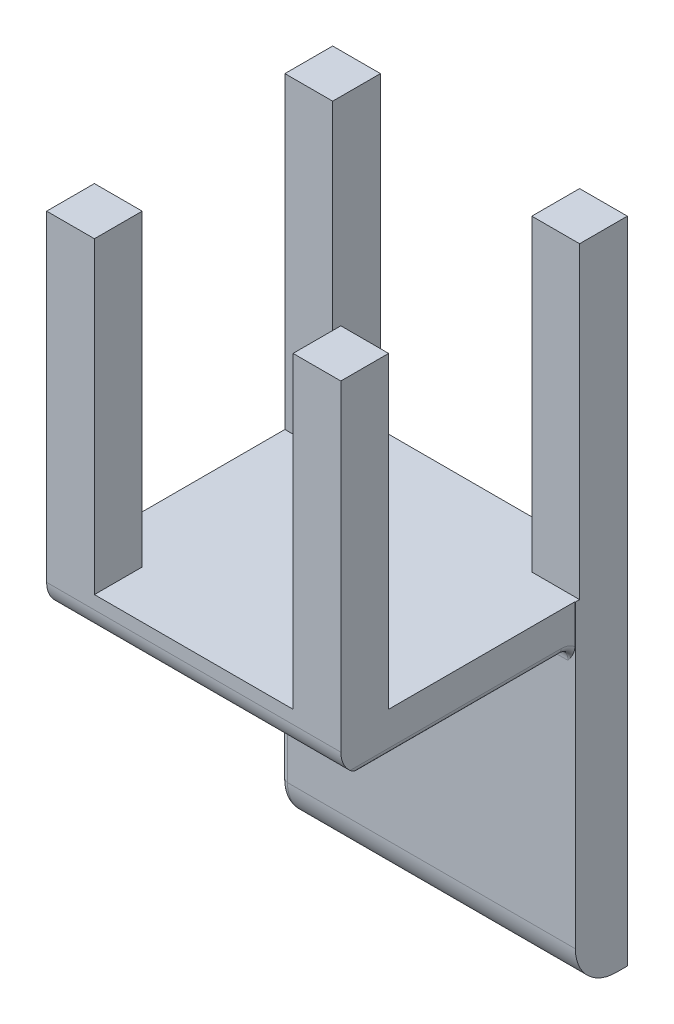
ISO-10303-21;
HEADER;
FILE_DESCRIPTION(('STEP AP214'),'2;1');
FILE_NAME('part.step','',(''),(''),'','','');
FILE_SCHEMA(('AUTOMOTIVE_DESIGN { 1 0 10303 214 1 1 1 1 }'));
ENDSEC;
DATA;
#1=APPLICATION_CONTEXT('core data for automotive mechanical design processes');
#2=APPLICATION_PROTOCOL_DEFINITION('international standard','automotive_design',2000,#1);
#3=PRODUCT_CONTEXT('',#1,'mechanical');
#4=PRODUCT('Part','Part','',(#3));
#5=PRODUCT_RELATED_PRODUCT_CATEGORY('part','',(#4));
#6=PRODUCT_DEFINITION_FORMATION('','',#4);
#7=PRODUCT_DEFINITION_CONTEXT('part definition',#1,'design');
#8=PRODUCT_DEFINITION('design','',#6,#7);
#9=PRODUCT_DEFINITION_SHAPE('','',#8);
#10=(LENGTH_UNIT() NAMED_UNIT(*) SI_UNIT(.MILLI.,.METRE.));
#11=(NAMED_UNIT(*) PLANE_ANGLE_UNIT() SI_UNIT($,.RADIAN.));
#12=(NAMED_UNIT(*) SI_UNIT($,.STERADIAN.) SOLID_ANGLE_UNIT());
#13=UNCERTAINTY_MEASURE_WITH_UNIT(LENGTH_MEASURE(1.E-05),#10,'distance_accuracy_value','');
#14=(GEOMETRIC_REPRESENTATION_CONTEXT(3) GLOBAL_UNCERTAINTY_ASSIGNED_CONTEXT((#13)) GLOBAL_UNIT_ASSIGNED_CONTEXT((#10,
#11,#12)) REPRESENTATION_CONTEXT('',''));
#15=CARTESIAN_POINT('',(0.,0.,0.));
#16=DIRECTION('',(0.,0.,1.));
#17=DIRECTION('',(1.,0.,0.));
#18=AXIS2_PLACEMENT_3D('',#15,#16,#17);
#19=CARTESIAN_POINT('',(-36.936387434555,59.4273560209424,-76.2));
#20=DIRECTION('',(0.,1.,0.));
#21=DIRECTION('',(0.,0.,1.));
#22=AXIS2_PLACEMENT_3D('',#19,#20,#21);
#23=PLANE('',#22);
#24=DIRECTION('',(0.,0.,-1.));
#25=VECTOR('',#24,1.);
#26=CARTESIAN_POINT('',(33.063612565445,59.4273560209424,-76.2));
#27=LINE('',#26,#25);
#28=CARTESIAN_POINT('',(33.063612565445,59.4273560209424,-6.20000000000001));
#29=VERTEX_POINT('',#28);
#30=CARTESIAN_POINT('',(33.063612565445,59.4273560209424,-76.2));
#31=VERTEX_POINT('',#30);
#32=EDGE_CURVE('E1007',#29,#31,#27,.T.);
#33=ORIENTED_EDGE('',*,*,#32,.F.);
#34=DIRECTION('',(1.,0.,0.));
#35=VECTOR('',#34,1.);
#36=CARTESIAN_POINT('',(-36.936387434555,59.4273560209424,-6.2));
#37=LINE('',#36,#35);
#38=CARTESIAN_POINT('',(-36.936387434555,59.4273560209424,-6.20000000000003));
#39=VERTEX_POINT('',#38);
#40=EDGE_CURVE('E1140',#39,#29,#37,.T.);
#41=ORIENTED_EDGE('',*,*,#40,.F.);
#42=DIRECTION('',(0.,0.,1.));
#43=VECTOR('',#42,1.);
#44=CARTESIAN_POINT('',(-36.936387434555,59.4273560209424,-76.2));
#45=LINE('',#44,#43);
#46=CARTESIAN_POINT('',(-36.936387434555,59.4273560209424,272.9));
#47=VERTEX_POINT('',#46);
#48=EDGE_CURVE('E1011',#39,#47,#45,.T.);
#49=ORIENTED_EDGE('',*,*,#48,.T.);
#50=DIRECTION('',(-1.,0.,0.));
#51=VECTOR('',#50,1.);
#52=CARTESIAN_POINT('',(-36.9363874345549,59.4273560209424,272.9));
#53=LINE('',#52,#51);
#54=CARTESIAN_POINT('',(33.0636125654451,59.4273560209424,272.9));
#55=VERTEX_POINT('',#54);
#56=EDGE_CURVE('E1072',#55,#47,#53,.T.);
#57=ORIENTED_EDGE('',*,*,#56,.F.);
#58=DIRECTION('',(0.,0.,-1.));
#59=VECTOR('',#58,1.);
#60=CARTESIAN_POINT('',(33.0636125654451,59.4273560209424,342.9));
#61=LINE('',#60,#59);
#62=CARTESIAN_POINT('',(33.0636125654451,59.4273560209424,342.9));
#63=VERTEX_POINT('',#62);
#64=EDGE_CURVE('E1066',#63,#55,#61,.T.);
#65=ORIENTED_EDGE('',*,*,#64,.F.);
#66=DIRECTION('',(1.,0.,0.));
#67=VECTOR('',#66,1.);
#68=CARTESIAN_POINT('',(-36.9363874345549,59.4273560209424,342.9));
#69=LINE('',#68,#67);
#70=CARTESIAN_POINT('',(324.12168816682,59.4273560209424,342.9));
#71=VERTEX_POINT('',#70);
#72=EDGE_CURVE('E1102',#63,#71,#69,.T.);
#73=ORIENTED_EDGE('',*,*,#72,.T.);
#74=DIRECTION('',(0.,0.,1.));
#75=VECTOR('',#74,1.);
#76=CARTESIAN_POINT('',(324.12168816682,59.4273560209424,342.9));
#77=LINE('',#76,#75);
#78=CARTESIAN_POINT('',(324.12168816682,59.4273560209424,272.9));
#79=VERTEX_POINT('',#78);
#80=EDGE_CURVE('E1044',#79,#71,#77,.T.);
#81=ORIENTED_EDGE('',*,*,#80,.F.);
#82=DIRECTION('',(-1.,0.,0.));
#83=VECTOR('',#82,1.);
#84=CARTESIAN_POINT('',(394.12168816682,59.4273560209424,272.9));
#85=LINE('',#84,#83);
#86=CARTESIAN_POINT('',(394.12168816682,59.4273560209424,272.9));
#87=VERTEX_POINT('',#86);
#88=EDGE_CURVE('E1041',#87,#79,#85,.T.);
#89=ORIENTED_EDGE('',*,*,#88,.F.);
#90=DIRECTION('',(0.,0.,-1.));
#91=VECTOR('',#90,1.);
#92=CARTESIAN_POINT('',(394.12168816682,59.4273560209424,-76.2));
#93=LINE('',#92,#91);
#94=CARTESIAN_POINT('',(394.12168816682,59.4273560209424,0.));
#95=VERTEX_POINT('',#94);
#96=EDGE_CURVE('E1106',#87,#95,#93,.T.);
#97=ORIENTED_EDGE('',*,*,#96,.T.);
#98=DIRECTION('',(-1.,0.,0.));
#99=VECTOR('',#98,1.);
#100=CARTESIAN_POINT('',(-36.936387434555,59.4273560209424,0.));
#101=LINE('',#100,#99);
#102=CARTESIAN_POINT('',(394.863612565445,59.4273560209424,0.));
#103=VERTEX_POINT('',#102);
#104=EDGE_CURVE('E1119',#103,#95,#101,.T.);
#105=ORIENTED_EDGE('',*,*,#104,.F.);
#106=DIRECTION('',(0.,0.,1.));
#107=VECTOR('',#106,1.);
#108=CARTESIAN_POINT('',(394.863612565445,59.4273560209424,-76.2));
#109=LINE('',#108,#107);
#110=CARTESIAN_POINT('',(394.863612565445,59.4273560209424,-6.20000000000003));
#111=VERTEX_POINT('',#110);
#112=EDGE_CURVE('E1087',#111,#103,#109,.T.);
#113=ORIENTED_EDGE('',*,*,#112,.F.);
#114=DIRECTION('',(1.,0.,0.));
#115=VECTOR('',#114,1.);
#116=CARTESIAN_POINT('',(394.863612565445,59.4273560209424,-6.2));
#117=LINE('',#116,#115);
#118=CARTESIAN_POINT('',(324.863612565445,59.4273560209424,-6.2));
#119=VERTEX_POINT('',#118);
#120=EDGE_CURVE('E1015',#119,#111,#117,.T.);
#121=ORIENTED_EDGE('',*,*,#120,.F.);
#122=DIRECTION('',(0.,0.,1.));
#123=VECTOR('',#122,1.);
#124=CARTESIAN_POINT('',(324.863612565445,59.4273560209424,-76.2));
#125=LINE('',#124,#123);
#126=CARTESIAN_POINT('',(324.863612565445,59.4273560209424,-76.2));
#127=VERTEX_POINT('',#126);
#128=EDGE_CURVE('E1012',#127,#119,#125,.T.);
#129=ORIENTED_EDGE('',*,*,#128,.F.);
#130=DIRECTION('',(-1.,0.,0.));
#131=VECTOR('',#130,1.);
#132=CARTESIAN_POINT('',(-36.936387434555,59.4273560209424,-76.2));
#133=LINE('',#132,#131);
#134=EDGE_CURVE('E1093',#127,#31,#133,.T.);
#135=ORIENTED_EDGE('',*,*,#134,.T.);
#136=EDGE_LOOP('',(#33,#41,#49,#57,#65,#73,#81,#89,#97,#105,#113,#121,#129,#135));
#137=FACE_BOUND('',#136,.T.);
#138=ADVANCED_FACE('F811',(#137),#23,.T.);
#139=CARTESIAN_POINT('',(-36.9363874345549,-440.572643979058,0.));
#140=DIRECTION('',(0.,0.,1.));
#141=DIRECTION('',(1.,0.,0.));
#142=AXIS2_PLACEMENT_3D('',#139,#140,#141);
#143=PLANE('',#142);
#144=DIRECTION('',(-1.,0.,0.));
#145=VECTOR('',#144,1.);
#146=CARTESIAN_POINT('',(-36.9363874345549,-20.,0.));
#147=LINE('',#146,#145);
#148=CARTESIAN_POINT('',(384.12168816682,-20.,0.));
#149=VERTEX_POINT('',#148);
#150=CARTESIAN_POINT('',(-26.936387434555,-20.,0.));
#151=VERTEX_POINT('',#150);
#152=EDGE_CURVE('E1266',#149,#151,#147,.T.);
#153=ORIENTED_EDGE('',*,*,#152,.T.);
#154=DIRECTION('',(0.,-1.,0.));
#155=VECTOR('',#154,1.);
#156=CARTESIAN_POINT('',(-26.9363874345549,-440.572643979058,0.));
#157=LINE('',#156,#155);
#158=CARTESIAN_POINT('',(-26.9363874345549,-380.572643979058,0.));
#159=VERTEX_POINT('',#158);
#160=EDGE_CURVE('E1187',#151,#159,#157,.T.);
#161=ORIENTED_EDGE('',*,*,#160,.T.);
#162=DIRECTION('',(1.,0.,0.));
#163=VECTOR('',#162,1.);
#164=CARTESIAN_POINT('',(-36.9363874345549,-380.572643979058,0.));
#165=LINE('',#164,#163);
#166=CARTESIAN_POINT('',(394.863612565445,-380.572643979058,0.));
#167=VERTEX_POINT('',#166);
#168=EDGE_CURVE('E1088',#159,#167,#165,.T.);
#169=ORIENTED_EDGE('',*,*,#168,.T.);
#170=DIRECTION('',(0.,1.,0.));
#171=VECTOR('',#170,1.);
#172=CARTESIAN_POINT('',(394.863612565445,59.4273560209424,0.));
#173=LINE('',#172,#171);
#174=EDGE_CURVE('E1117',#167,#103,#173,.T.);
#175=ORIENTED_EDGE('',*,*,#174,.T.);
#176=ORIENTED_EDGE('',*,*,#104,.T.);
#177=DIRECTION('',(0.,-1.,0.));
#178=VECTOR('',#177,1.);
#179=CARTESIAN_POINT('',(394.12168816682,-440.572643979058,0.));
#180=LINE('',#179,#178);
#181=CARTESIAN_POINT('',(394.12168816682,2.36067977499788,0.));
#182=VERTEX_POINT('',#181);
#183=EDGE_CURVE('E1086',#95,#182,#180,.T.);
#184=ORIENTED_EDGE('',*,*,#183,.T.);
#185=CARTESIAN_POINT('',(394.12168816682,2.36067977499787,0.));
#186=CARTESIAN_POINT('',(394.121655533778,1.76680180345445,0.));
#187=CARTESIAN_POINT('',(394.092316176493,1.17350545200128,0.));
#188=CARTESIAN_POINT('',(393.98124495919,-0.00705360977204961,0.));
#189=CARTESIAN_POINT('',(393.899617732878,-0.594325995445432,0.));
#190=CARTESIAN_POINT('',(393.69186596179,-1.75077305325,0.));
#191=CARTESIAN_POINT('',(393.566495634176,-2.32008651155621,0.));
#192=CARTESIAN_POINT('',(393.276405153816,-3.4487804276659,0.));
#193=CARTESIAN_POINT('',(393.11166298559,-4.00815513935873,0.));
#194=CARTESIAN_POINT('',(392.531699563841,-5.77388771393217,0.));
#195=CARTESIAN_POINT('',(392.051462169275,-6.95917298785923,0.));
#196=CARTESIAN_POINT('',(391.243384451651,-8.69510351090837,0.));
#197=CARTESIAN_POINT('',(390.959113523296,-9.26723662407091,0.));
#198=CARTESIAN_POINT('',(390.366142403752,-10.3987394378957,0.));
#199=CARTESIAN_POINT('',(390.057444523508,-10.9581103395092,0.));
#200=CARTESIAN_POINT('',(389.09608206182,-12.6288832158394,0.));
#201=CARTESIAN_POINT('',(388.413095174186,-13.7227184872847,0.));
#202=CARTESIAN_POINT('',(387.000753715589,-15.8784951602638,0.));
#203=CARTESIAN_POINT('',(386.271420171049,-16.9404507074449,0.));
#204=CARTESIAN_POINT('',(385.070518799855,-18.6580603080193,0.));
#205=CARTESIAN_POINT('',(384.604290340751,-19.3174964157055,0.));
#206=CARTESIAN_POINT('',(384.132574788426,-19.9846039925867,0.));
#207=CARTESIAN_POINT('',(384.127131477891,-19.9923019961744,0.));
#208=CARTESIAN_POINT('',(384.12168816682,-20.,0.));
#209=B_SPLINE_CURVE_WITH_KNOTS('',3,(#185,#186,#187,#188,#189,#190,#191,#192,#193,#194,#195,
#196,#197,#198,#199,#200,#201,#202,#203,#204,#205,#206,#207,#208),.UNSPECIFIED.,.F.,.F.,(4,2,2,
2,2,2,2,2,2,2,2,4),(0.,1.78007201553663,3.55659299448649,5.30388464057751,7.05215561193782,
10.8779322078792,12.7942256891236,14.7103380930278,18.5765462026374,22.4410126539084,
24.8638369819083,24.8921212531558),.UNSPECIFIED.);
#210=EDGE_CURVE('E1231',#182,#149,#209,.T.);
#211=ORIENTED_EDGE('',*,*,#210,.T.);
#212=EDGE_LOOP('',(#153,#161,#169,#175,#176,#184,#211));
#213=FACE_BOUND('',#212,.T.);
#214=ADVANCED_FACE('F1242',(#213),#143,.T.);
#215=CARTESIAN_POINT('',(-36.936387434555,59.4273560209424,-76.2));
#216=DIRECTION('',(-1.,0.,0.));
#217=DIRECTION('',(0.,-1.,0.));
#218=AXIS2_PLACEMENT_3D('',#215,#216,#217);
#219=PLANE('',#218);
#220=DIRECTION('',(0.,0.,1.));
#221=VECTOR('',#220,1.);
#222=CARTESIAN_POINT('',(-36.936387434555,9.99999999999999,342.9));
#223=LINE('',#222,#221);
#224=CARTESIAN_POINT('',(-36.936387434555,9.99999999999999,20.));
#225=VERTEX_POINT('',#224);
#226=CARTESIAN_POINT('',(-36.936387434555,10.,329.357513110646));
#227=VERTEX_POINT('',#226);
#228=EDGE_CURVE('E1238',#225,#227,#223,.T.);
#229=ORIENTED_EDGE('',*,*,#228,.T.);
#230=CARTESIAN_POINT('',(-36.936387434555,40.,302.9));
#231=DIRECTION('',(-1.,0.,0.));
#232=DIRECTION('',(0.,-1.,0.));
#233=AXIS2_PLACEMENT_3D('',#230,#231,#232);
#234=CIRCLE('',#233,40.);
#235=CARTESIAN_POINT('',(-36.9363874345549,40.,342.9));
#236=VERTEX_POINT('',#235);
#237=EDGE_CURVE('E12',#227,#236,#234,.T.);
#238=ORIENTED_EDGE('',*,*,#237,.T.);
#239=DIRECTION('',(0.,-1.,0.));
#240=VECTOR('',#239,1.);
#241=CARTESIAN_POINT('',(-36.9363874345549,59.4273560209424,342.9));
#242=LINE('',#241,#240);
#243=CARTESIAN_POINT('',(-36.9363874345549,511.027356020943,342.9));
#244=VERTEX_POINT('',#243);
#245=EDGE_CURVE('E1114',#244,#236,#242,.T.);
#246=ORIENTED_EDGE('',*,*,#245,.F.);
#247=DIRECTION('',(0.,0.,1.));
#248=VECTOR('',#247,1.);
#249=CARTESIAN_POINT('',(-36.9363874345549,511.027356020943,342.9));
#250=LINE('',#249,#248);
#251=CARTESIAN_POINT('',(-36.9363874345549,511.027356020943,272.9));
#252=VERTEX_POINT('',#251);
#253=EDGE_CURVE('E1069',#252,#244,#250,.T.);
#254=ORIENTED_EDGE('',*,*,#253,.F.);
#255=DIRECTION('',(0.,-1.,0.));
#256=VECTOR('',#255,1.);
#257=CARTESIAN_POINT('',(-36.9363874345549,511.027356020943,272.9));
#258=LINE('',#257,#256);
#259=EDGE_CURVE('E1078',#252,#47,#258,.T.);
#260=ORIENTED_EDGE('',*,*,#259,.T.);
#261=ORIENTED_EDGE('',*,*,#48,.F.);
#262=DIRECTION('',(0.,-1.,0.));
#263=VECTOR('',#262,1.);
#264=CARTESIAN_POINT('',(-36.936387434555,511.027356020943,-6.2));
#265=LINE('',#264,#263);
#266=CARTESIAN_POINT('',(-36.936387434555,511.027356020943,-6.2));
#267=VERTEX_POINT('',#266);
#268=EDGE_CURVE('E992',#267,#39,#265,.T.);
#269=ORIENTED_EDGE('',*,*,#268,.F.);
#270=DIRECTION('',(0.,0.,1.));
#271=VECTOR('',#270,1.);
#272=CARTESIAN_POINT('',(-36.936387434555,511.027356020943,-76.2));
#273=LINE('',#272,#271);
#274=CARTESIAN_POINT('',(-36.936387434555,511.027356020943,-76.2));
#275=VERTEX_POINT('',#274);
#276=EDGE_CURVE('E998',#275,#267,#273,.T.);
#277=ORIENTED_EDGE('',*,*,#276,.F.);
#278=DIRECTION('',(0.,-1.,0.));
#279=VECTOR('',#278,1.);
#280=CARTESIAN_POINT('',(-36.936387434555,59.4273560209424,-76.2));
#281=LINE('',#280,#279);
#282=CARTESIAN_POINT('',(-36.9363874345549,-430.572643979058,-76.2));
#283=VERTEX_POINT('',#282);
#284=EDGE_CURVE('E1122',#275,#283,#281,.T.);
#285=ORIENTED_EDGE('',*,*,#284,.T.);
#286=DIRECTION('',(0.,0.,1.));
#287=VECTOR('',#286,1.);
#288=CARTESIAN_POINT('',(-36.9363874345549,-430.572643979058,-76.2));
#289=LINE('',#288,#287);
#290=CARTESIAN_POINT('',(-36.9363874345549,-430.572643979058,-60.));
#291=VERTEX_POINT('',#290);
#292=EDGE_CURVE('E1169',#283,#291,#289,.T.);
#293=ORIENTED_EDGE('',*,*,#292,.T.);
#294=CARTESIAN_POINT('',(-36.9363874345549,-380.572643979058,-60.));
#295=DIRECTION('',(-1.,0.,0.));
#296=DIRECTION('',(0.,-1.,0.));
#297=AXIS2_PLACEMENT_3D('',#294,#295,#296);
#298=CIRCLE('',#297,50.);
#299=CARTESIAN_POINT('',(-36.9363874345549,-380.572643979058,-10.));
#300=VERTEX_POINT('',#299);
#301=EDGE_CURVE('E1173',#291,#300,#298,.T.);
#302=ORIENTED_EDGE('',*,*,#301,.T.);
#303=DIRECTION('',(0.,-1.,0.));
#304=VECTOR('',#303,1.);
#305=CARTESIAN_POINT('',(-36.936387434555,59.4273560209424,-9.99999999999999));
#306=LINE('',#305,#304);
#307=CARTESIAN_POINT('',(-36.936387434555,-20.,-10.));
#308=VERTEX_POINT('',#307);
#309=EDGE_CURVE('E1177',#300,#308,#306,.F.);
#310=ORIENTED_EDGE('',*,*,#309,.T.);
#311=CARTESIAN_POINT('',(-36.936387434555,-20.,20.));
#312=DIRECTION('',(-1.,0.,0.));
#313=DIRECTION('',(0.,-1.,0.));
#314=AXIS2_PLACEMENT_3D('',#311,#312,#313);
#315=CIRCLE('',#314,30.);
#316=EDGE_CURVE('E1651',#308,#225,#315,.F.);
#317=ORIENTED_EDGE('',*,*,#316,.T.);
#318=EDGE_LOOP('',(#229,#238,#246,#254,#260,#261,#269,#277,#285,#293,#302,#310,#317));
#319=FACE_BOUND('',#318,.T.);
#320=ADVANCED_FACE('F813',(#319),#219,.T.);
#321=CARTESIAN_POINT('',(394.863612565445,59.4273560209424,-76.2));
#322=DIRECTION('',(1.,0.,0.));
#323=DIRECTION('',(0.,1.,0.));
#324=AXIS2_PLACEMENT_3D('',#321,#322,#323);
#325=PLANE('',#324);
#326=ORIENTED_EDGE('',*,*,#174,.F.);
#327=CARTESIAN_POINT('',(394.863612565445,-380.572643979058,-60.));
#328=DIRECTION('',(1.,0.,0.));
#329=DIRECTION('',(0.,1.,0.));
#330=AXIS2_PLACEMENT_3D('',#327,#328,#329);
#331=CIRCLE('',#330,60.);
#332=CARTESIAN_POINT('',(394.863612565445,-440.572643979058,-60.));
#333=VERTEX_POINT('',#332);
#334=EDGE_CURVE('E1267',#167,#333,#331,.T.);
#335=ORIENTED_EDGE('',*,*,#334,.T.);
#336=DIRECTION('',(0.,0.,1.));
#337=VECTOR('',#336,1.);
#338=CARTESIAN_POINT('',(394.863612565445,-440.572643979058,-76.2));
#339=LINE('',#338,#337);
#340=CARTESIAN_POINT('',(394.863612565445,-440.572643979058,-76.2));
#341=VERTEX_POINT('',#340);
#342=EDGE_CURVE('E1097',#341,#333,#339,.T.);
#343=ORIENTED_EDGE('',*,*,#342,.F.);
#344=DIRECTION('',(0.,1.,0.));
#345=VECTOR('',#344,1.);
#346=CARTESIAN_POINT('',(394.863612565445,59.4273560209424,-76.2));
#347=LINE('',#346,#345);
#348=CARTESIAN_POINT('',(394.863612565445,511.027356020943,-76.2));
#349=VERTEX_POINT('',#348);
#350=EDGE_CURVE('E1125',#341,#349,#347,.T.);
#351=ORIENTED_EDGE('',*,*,#350,.T.);
#352=DIRECTION('',(0.,0.,-1.));
#353=VECTOR('',#352,1.);
#354=CARTESIAN_POINT('',(394.863612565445,511.027356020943,-76.2));
#355=LINE('',#354,#353);
#356=CARTESIAN_POINT('',(394.863612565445,511.027356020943,-6.2));
#357=VERTEX_POINT('',#356);
#358=EDGE_CURVE('E1023',#357,#349,#355,.T.);
#359=ORIENTED_EDGE('',*,*,#358,.F.);
#360=DIRECTION('',(0.,-1.,0.));
#361=VECTOR('',#360,1.);
#362=CARTESIAN_POINT('',(394.863612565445,511.027356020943,-6.2));
#363=LINE('',#362,#361);
#364=EDGE_CURVE('E1032',#357,#111,#363,.T.);
#365=ORIENTED_EDGE('',*,*,#364,.T.);
#366=ORIENTED_EDGE('',*,*,#112,.T.);
#367=EDGE_LOOP('',(#326,#335,#343,#351,#359,#365,#366));
#368=FACE_BOUND('',#367,.T.);
#369=ADVANCED_FACE('F1255',(#368),#325,.T.);
#370=CARTESIAN_POINT('',(-36.9363874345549,-440.572643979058,-76.2));
#371=DIRECTION('',(0.,-1.,0.));
#372=DIRECTION('',(0.,0.,-1.));
#373=AXIS2_PLACEMENT_3D('',#370,#371,#372);
#374=PLANE('',#373);
#375=DIRECTION('',(1.,0.,0.));
#376=VECTOR('',#375,1.);
#377=CARTESIAN_POINT('',(-36.9363874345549,-440.572643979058,-60.));
#378=LINE('',#377,#376);
#379=CARTESIAN_POINT('',(-26.9363874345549,-440.572643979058,-60.));
#380=VERTEX_POINT('',#379);
#381=EDGE_CURVE('E1263',#333,#380,#378,.F.);
#382=ORIENTED_EDGE('',*,*,#381,.T.);
#383=DIRECTION('',(0.,0.,1.));
#384=VECTOR('',#383,1.);
#385=CARTESIAN_POINT('',(-26.9363874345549,-440.572643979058,-76.2));
#386=LINE('',#385,#384);
#387=CARTESIAN_POINT('',(-26.9363874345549,-440.572643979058,-76.2));
#388=VERTEX_POINT('',#387);
#389=EDGE_CURVE('E1170',#380,#388,#386,.F.);
#390=ORIENTED_EDGE('',*,*,#389,.T.);
#391=DIRECTION('',(1.,0.,0.));
#392=VECTOR('',#391,1.);
#393=CARTESIAN_POINT('',(-36.9363874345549,-440.572643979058,-76.2));
#394=LINE('',#393,#392);
#395=EDGE_CURVE('E1124',#388,#341,#394,.T.);
#396=ORIENTED_EDGE('',*,*,#395,.T.);
#397=ORIENTED_EDGE('',*,*,#342,.T.);
#398=EDGE_LOOP('',(#382,#390,#396,#397));
#399=FACE_BOUND('',#398,.T.);
#400=ADVANCED_FACE('F1252',(#399),#374,.T.);
#401=CARTESIAN_POINT('',(-36.9363874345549,-440.572643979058,-76.2));
#402=DIRECTION('',(0.,0.,1.));
#403=DIRECTION('',(1.,0.,0.));
#404=AXIS2_PLACEMENT_3D('',#401,#402,#403);
#405=PLANE('',#404);
#406=ORIENTED_EDGE('',*,*,#395,.F.);
#407=CARTESIAN_POINT('',(-26.9363874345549,-430.572643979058,-76.2));
#408=DIRECTION('',(0.,0.,1.));
#409=DIRECTION('',(1.,0.,0.));
#410=AXIS2_PLACEMENT_3D('',#407,#408,#409);
#411=CIRCLE('',#410,10.);
#412=EDGE_CURVE('E1180',#388,#283,#411,.F.);
#413=ORIENTED_EDGE('',*,*,#412,.T.);
#414=ORIENTED_EDGE('',*,*,#284,.F.);
#415=DIRECTION('',(-1.,0.,0.));
#416=VECTOR('',#415,1.);
#417=CARTESIAN_POINT('',(-36.936387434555,511.027356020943,-76.2));
#418=LINE('',#417,#416);
#419=CARTESIAN_POINT('',(33.063612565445,511.027356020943,-76.2));
#420=VERTEX_POINT('',#419);
#421=EDGE_CURVE('E1004',#420,#275,#418,.T.);
#422=ORIENTED_EDGE('',*,*,#421,.F.);
#423=DIRECTION('',(0.,-1.,0.));
#424=VECTOR('',#423,1.);
#425=CARTESIAN_POINT('',(33.063612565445,511.027356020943,-76.2));
#426=LINE('',#425,#424);
#427=EDGE_CURVE('E1017',#420,#31,#426,.T.);
#428=ORIENTED_EDGE('',*,*,#427,.T.);
#429=ORIENTED_EDGE('',*,*,#134,.F.);
#430=DIRECTION('',(0.,-1.,0.));
#431=VECTOR('',#430,1.);
#432=CARTESIAN_POINT('',(324.863612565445,511.027356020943,-76.2));
#433=LINE('',#432,#431);
#434=CARTESIAN_POINT('',(324.863612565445,511.027356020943,-76.2));
#435=VERTEX_POINT('',#434);
#436=EDGE_CURVE('E1038',#435,#127,#433,.T.);
#437=ORIENTED_EDGE('',*,*,#436,.F.);
#438=DIRECTION('',(-1.,0.,0.));
#439=VECTOR('',#438,1.);
#440=CARTESIAN_POINT('',(394.863612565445,511.027356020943,-76.2));
#441=LINE('',#440,#439);
#442=EDGE_CURVE('E1026',#349,#435,#441,.T.);
#443=ORIENTED_EDGE('',*,*,#442,.F.);
#444=ORIENTED_EDGE('',*,*,#350,.F.);
#445=EDGE_LOOP('',(#406,#413,#414,#422,#428,#429,#437,#443,#444));
#446=FACE_BOUND('',#445,.T.);
#447=ADVANCED_FACE('F1143',(#446),#405,.F.);
#448=CARTESIAN_POINT('',(394.12168816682,59.4273560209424,-76.2));
#449=DIRECTION('',(-1.,0.,0.));
#450=DIRECTION('',(0.,0.,1.));
#451=AXIS2_PLACEMENT_3D('',#448,#449,#450);
#452=PLANE('',#451);
#453=DIRECTION('',(0.,-1.,0.));
#454=VECTOR('',#453,1.);
#455=CARTESIAN_POINT('',(394.12168816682,59.4273560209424,342.9));
#456=LINE('',#455,#454);
#457=CARTESIAN_POINT('',(394.12168816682,511.027356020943,342.9));
#458=VERTEX_POINT('',#457);
#459=CARTESIAN_POINT('',(394.12168816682,40.,342.9));
#460=VERTEX_POINT('',#459);
#461=EDGE_CURVE('E1105',#458,#460,#456,.T.);
#462=ORIENTED_EDGE('',*,*,#461,.T.);
#463=CARTESIAN_POINT('',(394.12168816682,40.,302.9));
#464=DIRECTION('',(-1.,0.,0.));
#465=DIRECTION('',(0.,0.,1.));
#466=AXIS2_PLACEMENT_3D('',#463,#464,#465);
#467=CIRCLE('',#466,40.);
#468=CARTESIAN_POINT('',(394.12168816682,9.99999999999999,329.357513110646));
#469=VERTEX_POINT('',#468);
#470=EDGE_CURVE('E1196',#460,#469,#467,.F.);
#471=ORIENTED_EDGE('',*,*,#470,.T.);
#472=DIRECTION('',(0.,0.,-1.));
#473=VECTOR('',#472,1.);
#474=CARTESIAN_POINT('',(394.12168816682,9.99999999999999,-76.2));
#475=LINE('',#474,#473);
#476=CARTESIAN_POINT('',(394.12168816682,9.99999999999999,20.));
#477=VERTEX_POINT('',#476);
#478=EDGE_CURVE('E1274',#469,#477,#475,.T.);
#479=ORIENTED_EDGE('',*,*,#478,.T.);
#480=CARTESIAN_POINT('',(394.12168816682,-20.,20.));
#481=DIRECTION('',(-1.,0.,0.));
#482=DIRECTION('',(0.,0.,1.));
#483=AXIS2_PLACEMENT_3D('',#480,#481,#482);
#484=CIRCLE('',#483,30.);
#485=EDGE_CURVE('E1276',#477,#182,#484,.T.);
#486=ORIENTED_EDGE('',*,*,#485,.T.);
#487=ORIENTED_EDGE('',*,*,#183,.F.);
#488=ORIENTED_EDGE('',*,*,#96,.F.);
#489=DIRECTION('',(0.,-1.,0.));
#490=VECTOR('',#489,1.);
#491=CARTESIAN_POINT('',(394.12168816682,511.027356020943,272.9));
#492=LINE('',#491,#490);
#493=CARTESIAN_POINT('',(394.12168816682,511.027356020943,272.9));
#494=VERTEX_POINT('',#493);
#495=EDGE_CURVE('E1063',#494,#87,#492,.T.);
#496=ORIENTED_EDGE('',*,*,#495,.F.);
#497=DIRECTION('',(0.,0.,-1.));
#498=VECTOR('',#497,1.);
#499=CARTESIAN_POINT('',(394.12168816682,511.027356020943,342.9));
#500=LINE('',#499,#498);
#501=EDGE_CURVE('E1047',#458,#494,#500,.T.);
#502=ORIENTED_EDGE('',*,*,#501,.F.);
#503=EDGE_LOOP('',(#462,#471,#479,#486,#487,#488,#496,#502));
#504=FACE_BOUND('',#503,.T.);
#505=ADVANCED_FACE('F1248',(#504),#452,.F.);
#506=CARTESIAN_POINT('',(-36.9363874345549,59.4273560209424,342.9));
#507=DIRECTION('',(0.,0.,-1.));
#508=DIRECTION('',(-1.,0.,0.));
#509=AXIS2_PLACEMENT_3D('',#506,#507,#508);
#510=PLANE('',#509);
#511=ORIENTED_EDGE('',*,*,#245,.T.);
#512=DIRECTION('',(1.,0.,0.));
#513=VECTOR('',#512,1.);
#514=CARTESIAN_POINT('',(-36.9363874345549,40.,342.9));
#515=LINE('',#514,#513);
#516=EDGE_CURVE('E1193',#236,#460,#515,.T.);
#517=ORIENTED_EDGE('',*,*,#516,.T.);
#518=ORIENTED_EDGE('',*,*,#461,.F.);
#519=DIRECTION('',(1.,0.,0.));
#520=VECTOR('',#519,1.);
#521=CARTESIAN_POINT('',(394.12168816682,511.027356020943,342.9));
#522=LINE('',#521,#520);
#523=CARTESIAN_POINT('',(324.12168816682,511.027356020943,342.9));
#524=VERTEX_POINT('',#523);
#525=EDGE_CURVE('E1054',#524,#458,#522,.T.);
#526=ORIENTED_EDGE('',*,*,#525,.F.);
#527=DIRECTION('',(0.,-1.,0.));
#528=VECTOR('',#527,1.);
#529=CARTESIAN_POINT('',(324.12168816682,511.027356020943,342.9));
#530=LINE('',#529,#528);
#531=EDGE_CURVE('E1057',#524,#71,#530,.T.);
#532=ORIENTED_EDGE('',*,*,#531,.T.);
#533=ORIENTED_EDGE('',*,*,#72,.F.);
#534=DIRECTION('',(0.,-1.,0.));
#535=VECTOR('',#534,1.);
#536=CARTESIAN_POINT('',(33.0636125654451,511.027356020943,342.9));
#537=LINE('',#536,#535);
#538=CARTESIAN_POINT('',(33.0636125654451,511.027356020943,342.9));
#539=VERTEX_POINT('',#538);
#540=EDGE_CURVE('E1300',#539,#63,#537,.T.);
#541=ORIENTED_EDGE('',*,*,#540,.F.);
#542=DIRECTION('',(1.,0.,0.));
#543=VECTOR('',#542,1.);
#544=CARTESIAN_POINT('',(-36.9363874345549,511.027356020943,342.9));
#545=LINE('',#544,#543);
#546=EDGE_CURVE('E1296',#244,#539,#545,.T.);
#547=ORIENTED_EDGE('',*,*,#546,.F.);
#548=EDGE_LOOP('',(#511,#517,#518,#526,#532,#533,#541,#547));
#549=FACE_BOUND('',#548,.T.);
#550=ADVANCED_FACE('F1294',(#549),#510,.F.);
#551=CARTESIAN_POINT('',(394.12168816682,0.,342.9));
#552=DIRECTION('',(0.,1.,0.));
#553=DIRECTION('',(0.,0.,1.));
#554=AXIS2_PLACEMENT_3D('',#551,#552,#553);
#555=PLANE('',#554);
#556=DIRECTION('',(0.,0.,-1.));
#557=VECTOR('',#556,1.);
#558=CARTESIAN_POINT('',(384.12168816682,0.,342.9));
#559=LINE('',#558,#557);
#560=CARTESIAN_POINT('',(384.12168816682,0.,20.));
#561=VERTEX_POINT('',#560);
#562=CARTESIAN_POINT('',(384.12168816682,0.,302.9));
#563=VERTEX_POINT('',#562);
#564=EDGE_CURVE('E1239',#561,#563,#559,.F.);
#565=ORIENTED_EDGE('',*,*,#564,.T.);
#566=DIRECTION('',(1.,0.,0.));
#567=VECTOR('',#566,1.);
#568=CARTESIAN_POINT('',(394.12168816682,0.,302.9));
#569=LINE('',#568,#567);
#570=CARTESIAN_POINT('',(-26.936387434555,0.,302.9));
#571=VERTEX_POINT('',#570);
#572=EDGE_CURVE('E833',#563,#571,#569,.F.);
#573=ORIENTED_EDGE('',*,*,#572,.T.);
#574=DIRECTION('',(0.,0.,1.));
#575=VECTOR('',#574,1.);
#576=CARTESIAN_POINT('',(-26.936387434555,0.,20.));
#577=LINE('',#576,#575);
#578=CARTESIAN_POINT('',(-26.936387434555,0.,20.));
#579=VERTEX_POINT('',#578);
#580=EDGE_CURVE('E1191',#571,#579,#577,.F.);
#581=ORIENTED_EDGE('',*,*,#580,.T.);
#582=DIRECTION('',(-1.,0.,0.));
#583=VECTOR('',#582,1.);
#584=CARTESIAN_POINT('',(394.12168816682,0.,20.));
#585=LINE('',#584,#583);
#586=EDGE_CURVE('E1270',#579,#561,#585,.F.);
#587=ORIENTED_EDGE('',*,*,#586,.T.);
#588=EDGE_LOOP('',(#565,#573,#581,#587));
#589=FACE_BOUND('',#588,.T.);
#590=ADVANCED_FACE('F1285',(#589),#555,.F.);
#591=CARTESIAN_POINT('',(33.0636125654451,511.027356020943,342.9));
#592=DIRECTION('',(-1.,0.,0.));
#593=DIRECTION('',(0.,0.,1.));
#594=AXIS2_PLACEMENT_3D('',#591,#592,#593);
#595=PLANE('',#594);
#596=ORIENTED_EDGE('',*,*,#64,.T.);
#597=DIRECTION('',(0.,-1.,0.));
#598=VECTOR('',#597,1.);
#599=CARTESIAN_POINT('',(33.0636125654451,511.027356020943,272.9));
#600=LINE('',#599,#598);
#601=CARTESIAN_POINT('',(33.0636125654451,511.027356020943,272.9));
#602=VERTEX_POINT('',#601);
#603=EDGE_CURVE('E1080',#602,#55,#600,.T.);
#604=ORIENTED_EDGE('',*,*,#603,.F.);
#605=DIRECTION('',(0.,0.,-1.));
#606=VECTOR('',#605,1.);
#607=CARTESIAN_POINT('',(33.0636125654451,511.027356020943,342.9));
#608=LINE('',#607,#606);
#609=EDGE_CURVE('E1303',#539,#602,#608,.T.);
#610=ORIENTED_EDGE('',*,*,#609,.F.);
#611=ORIENTED_EDGE('',*,*,#540,.T.);
#612=EDGE_LOOP('',(#596,#604,#610,#611));
#613=FACE_BOUND('',#612,.T.);
#614=ADVANCED_FACE('F1313',(#613),#595,.F.);
#615=CARTESIAN_POINT('',(-36.9363874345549,511.027356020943,272.9));
#616=DIRECTION('',(0.,0.,1.));
#617=DIRECTION('',(1.,0.,0.));
#618=AXIS2_PLACEMENT_3D('',#615,#616,#617);
#619=PLANE('',#618);
#620=ORIENTED_EDGE('',*,*,#56,.T.);
#621=ORIENTED_EDGE('',*,*,#259,.F.);
#622=DIRECTION('',(-1.,0.,0.));
#623=VECTOR('',#622,1.);
#624=CARTESIAN_POINT('',(-36.9363874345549,511.027356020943,272.9));
#625=LINE('',#624,#623);
#626=EDGE_CURVE('E1081',#602,#252,#625,.T.);
#627=ORIENTED_EDGE('',*,*,#626,.F.);
#628=ORIENTED_EDGE('',*,*,#603,.T.);
#629=EDGE_LOOP('',(#620,#621,#627,#628));
#630=FACE_BOUND('',#629,.T.);
#631=ADVANCED_FACE('F1308',(#630),#619,.F.);
#632=CARTESIAN_POINT('',(-36.9363874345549,511.027356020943,272.9));
#633=DIRECTION('',(0.,-1.,0.));
#634=DIRECTION('',(0.,0.,-1.));
#635=AXIS2_PLACEMENT_3D('',#632,#633,#634);
#636=PLANE('',#635);
#637=ORIENTED_EDGE('',*,*,#253,.T.);
#638=ORIENTED_EDGE('',*,*,#546,.T.);
#639=ORIENTED_EDGE('',*,*,#609,.T.);
#640=ORIENTED_EDGE('',*,*,#626,.T.);
#641=EDGE_LOOP('',(#637,#638,#639,#640));
#642=FACE_BOUND('',#641,.T.);
#643=ADVANCED_FACE('F1304',(#642),#636,.F.);
#644=CARTESIAN_POINT('',(394.12168816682,511.027356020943,272.9));
#645=DIRECTION('',(0.,0.,1.));
#646=DIRECTION('',(1.,0.,0.));
#647=AXIS2_PLACEMENT_3D('',#644,#645,#646);
#648=PLANE('',#647);
#649=ORIENTED_EDGE('',*,*,#88,.T.);
#650=DIRECTION('',(0.,-1.,0.));
#651=VECTOR('',#650,1.);
#652=CARTESIAN_POINT('',(324.12168816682,511.027356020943,272.9));
#653=LINE('',#652,#651);
#654=CARTESIAN_POINT('',(324.12168816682,511.027356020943,272.9));
#655=VERTEX_POINT('',#654);
#656=EDGE_CURVE('E1060',#655,#79,#653,.T.);
#657=ORIENTED_EDGE('',*,*,#656,.F.);
#658=DIRECTION('',(-1.,0.,0.));
#659=VECTOR('',#658,1.);
#660=CARTESIAN_POINT('',(394.12168816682,511.027356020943,272.9));
#661=LINE('',#660,#659);
#662=EDGE_CURVE('E1050',#494,#655,#661,.T.);
#663=ORIENTED_EDGE('',*,*,#662,.F.);
#664=ORIENTED_EDGE('',*,*,#495,.T.);
#665=EDGE_LOOP('',(#649,#657,#663,#664));
#666=FACE_BOUND('',#665,.T.);
#667=ADVANCED_FACE('F1354',(#666),#648,.F.);
#668=CARTESIAN_POINT('',(324.12168816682,511.027356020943,342.9));
#669=DIRECTION('',(1.,0.,0.));
#670=DIRECTION('',(0.,0.,-1.));
#671=AXIS2_PLACEMENT_3D('',#668,#669,#670);
#672=PLANE('',#671);
#673=ORIENTED_EDGE('',*,*,#80,.T.);
#674=ORIENTED_EDGE('',*,*,#531,.F.);
#675=DIRECTION('',(0.,0.,1.));
#676=VECTOR('',#675,1.);
#677=CARTESIAN_POINT('',(324.12168816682,511.027356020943,342.9));
#678=LINE('',#677,#676);
#679=EDGE_CURVE('E1052',#655,#524,#678,.T.);
#680=ORIENTED_EDGE('',*,*,#679,.F.);
#681=ORIENTED_EDGE('',*,*,#656,.T.);
#682=EDGE_LOOP('',(#673,#674,#680,#681));
#683=FACE_BOUND('',#682,.T.);
#684=ADVANCED_FACE('F1350',(#683),#672,.F.);
#685=CARTESIAN_POINT('',(394.12168816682,511.027356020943,272.9));
#686=DIRECTION('',(0.,1.,0.));
#687=DIRECTION('',(0.,0.,1.));
#688=AXIS2_PLACEMENT_3D('',#685,#686,#687);
#689=PLANE('',#688);
#690=ORIENTED_EDGE('',*,*,#501,.T.);
#691=ORIENTED_EDGE('',*,*,#662,.T.);
#692=ORIENTED_EDGE('',*,*,#679,.T.);
#693=ORIENTED_EDGE('',*,*,#525,.T.);
#694=EDGE_LOOP('',(#690,#691,#692,#693));
#695=FACE_BOUND('',#694,.T.);
#696=ADVANCED_FACE('F1347',(#695),#689,.T.);
#697=CARTESIAN_POINT('',(324.863612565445,511.027356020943,-76.2));
#698=DIRECTION('',(1.,0.,0.));
#699=DIRECTION('',(0.,0.,-1.));
#700=AXIS2_PLACEMENT_3D('',#697,#698,#699);
#701=PLANE('',#700);
#702=ORIENTED_EDGE('',*,*,#128,.T.);
#703=DIRECTION('',(0.,-1.,0.));
#704=VECTOR('',#703,1.);
#705=CARTESIAN_POINT('',(324.863612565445,511.027356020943,-6.2));
#706=LINE('',#705,#704);
#707=CARTESIAN_POINT('',(324.863612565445,511.027356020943,-6.2));
#708=VERTEX_POINT('',#707);
#709=EDGE_CURVE('E1035',#708,#119,#706,.T.);
#710=ORIENTED_EDGE('',*,*,#709,.F.);
#711=DIRECTION('',(0.,0.,1.));
#712=VECTOR('',#711,1.);
#713=CARTESIAN_POINT('',(324.863612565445,511.027356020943,-76.2));
#714=LINE('',#713,#712);
#715=EDGE_CURVE('E1028',#435,#708,#714,.T.);
#716=ORIENTED_EDGE('',*,*,#715,.F.);
#717=ORIENTED_EDGE('',*,*,#436,.T.);
#718=EDGE_LOOP('',(#702,#710,#716,#717));
#719=FACE_BOUND('',#718,.T.);
#720=ADVANCED_FACE('F1332',(#719),#701,.F.);
#721=CARTESIAN_POINT('',(394.863612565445,511.027356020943,-6.2));
#722=DIRECTION('',(0.,0.,-1.));
#723=DIRECTION('',(-1.,0.,0.));
#724=AXIS2_PLACEMENT_3D('',#721,#722,#723);
#725=PLANE('',#724);
#726=ORIENTED_EDGE('',*,*,#120,.T.);
#727=ORIENTED_EDGE('',*,*,#364,.F.);
#728=DIRECTION('',(1.,0.,0.));
#729=VECTOR('',#728,1.);
#730=CARTESIAN_POINT('',(394.863612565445,511.027356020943,-6.2));
#731=LINE('',#730,#729);
#732=EDGE_CURVE('E1030',#708,#357,#731,.T.);
#733=ORIENTED_EDGE('',*,*,#732,.F.);
#734=ORIENTED_EDGE('',*,*,#709,.T.);
#735=EDGE_LOOP('',(#726,#727,#733,#734));
#736=FACE_BOUND('',#735,.T.);
#737=ADVANCED_FACE('F1327',(#736),#725,.F.);
#738=CARTESIAN_POINT('',(394.863612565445,511.027356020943,-6.2));
#739=DIRECTION('',(0.,-1.,0.));
#740=DIRECTION('',(0.,0.,-1.));
#741=AXIS2_PLACEMENT_3D('',#738,#739,#740);
#742=PLANE('',#741);
#743=ORIENTED_EDGE('',*,*,#358,.T.);
#744=ORIENTED_EDGE('',*,*,#442,.T.);
#745=ORIENTED_EDGE('',*,*,#715,.T.);
#746=ORIENTED_EDGE('',*,*,#732,.T.);
#747=EDGE_LOOP('',(#743,#744,#745,#746));
#748=FACE_BOUND('',#747,.T.);
#749=ADVANCED_FACE('F1334',(#748),#742,.F.);
#750=CARTESIAN_POINT('',(-36.936387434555,511.027356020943,-6.2));
#751=DIRECTION('',(0.,0.,-1.));
#752=DIRECTION('',(-1.,0.,0.));
#753=AXIS2_PLACEMENT_3D('',#750,#751,#752);
#754=PLANE('',#753);
#755=ORIENTED_EDGE('',*,*,#40,.T.);
#756=DIRECTION('',(0.,-1.,0.));
#757=VECTOR('',#756,1.);
#758=CARTESIAN_POINT('',(33.063612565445,511.027356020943,-6.20000000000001));
#759=LINE('',#758,#757);
#760=CARTESIAN_POINT('',(33.063612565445,511.027356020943,-6.20000000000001));
#761=VERTEX_POINT('',#760);
#762=EDGE_CURVE('E994',#761,#29,#759,.T.);
#763=ORIENTED_EDGE('',*,*,#762,.F.);
#764=DIRECTION('',(1.,0.,0.));
#765=VECTOR('',#764,1.);
#766=CARTESIAN_POINT('',(-36.936387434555,511.027356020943,-6.2));
#767=LINE('',#766,#765);
#768=EDGE_CURVE('E987',#267,#761,#767,.T.);
#769=ORIENTED_EDGE('',*,*,#768,.F.);
#770=ORIENTED_EDGE('',*,*,#268,.T.);
#771=EDGE_LOOP('',(#755,#763,#769,#770));
#772=FACE_BOUND('',#771,.T.);
#773=ADVANCED_FACE('F990',(#772),#754,.F.);
#774=CARTESIAN_POINT('',(33.063612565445,511.027356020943,-76.2));
#775=DIRECTION('',(-1.,0.,0.));
#776=DIRECTION('',(0.,0.,1.));
#777=AXIS2_PLACEMENT_3D('',#774,#775,#776);
#778=PLANE('',#777);
#779=ORIENTED_EDGE('',*,*,#32,.T.);
#780=ORIENTED_EDGE('',*,*,#427,.F.);
#781=DIRECTION('',(0.,0.,-1.));
#782=VECTOR('',#781,1.);
#783=CARTESIAN_POINT('',(33.063612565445,511.027356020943,-76.2));
#784=LINE('',#783,#782);
#785=EDGE_CURVE('E997',#761,#420,#784,.T.);
#786=ORIENTED_EDGE('',*,*,#785,.F.);
#787=ORIENTED_EDGE('',*,*,#762,.T.);
#788=EDGE_LOOP('',(#779,#780,#786,#787));
#789=FACE_BOUND('',#788,.T.);
#790=ADVANCED_FACE('F1139',(#789),#778,.F.);
#791=CARTESIAN_POINT('',(-36.936387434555,511.027356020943,-6.2));
#792=DIRECTION('',(0.,1.,0.));
#793=DIRECTION('',(0.,0.,1.));
#794=AXIS2_PLACEMENT_3D('',#791,#792,#793);
#795=PLANE('',#794);
#796=ORIENTED_EDGE('',*,*,#276,.T.);
#797=ORIENTED_EDGE('',*,*,#768,.T.);
#798=ORIENTED_EDGE('',*,*,#785,.T.);
#799=ORIENTED_EDGE('',*,*,#421,.T.);
#800=EDGE_LOOP('',(#796,#797,#798,#799));
#801=FACE_BOUND('',#800,.T.);
#802=ADVANCED_FACE('F1002',(#801),#795,.T.);
#803=CARTESIAN_POINT('',(-36.9363874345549,-380.572643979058,-60.));
#804=DIRECTION('',(1.,0.,0.));
#805=DIRECTION('',(0.,0.,-1.));
#806=AXIS2_PLACEMENT_3D('',#803,#804,#805);
#807=CYLINDRICAL_SURFACE('',#806,60.);
#808=ORIENTED_EDGE('',*,*,#168,.F.);
#809=CARTESIAN_POINT('',(-26.9363874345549,-380.572643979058,-60.));
#810=DIRECTION('',(-1.,0.,0.));
#811=DIRECTION('',(0.,-1.,0.));
#812=AXIS2_PLACEMENT_3D('',#809,#810,#811);
#813=CIRCLE('',#812,60.);
#814=EDGE_CURVE('E1185',#159,#380,#813,.F.);
#815=ORIENTED_EDGE('',*,*,#814,.T.);
#816=ORIENTED_EDGE('',*,*,#381,.F.);
#817=ORIENTED_EDGE('',*,*,#334,.F.);
#818=EDGE_LOOP('',(#808,#815,#816,#817));
#819=FACE_BOUND('',#818,.T.);
#820=ADVANCED_FACE('F1453',(#819),#807,.T.);
#821=CARTESIAN_POINT('',(-36.9363874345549,-20.,20.));
#822=DIRECTION('',(-1.,0.,0.));
#823=DIRECTION('',(0.,0.,1.));
#824=AXIS2_PLACEMENT_3D('',#821,#822,#823);
#825=CYLINDRICAL_SURFACE('',#824,20.);
#826=ORIENTED_EDGE('',*,*,#586,.F.);
#827=CARTESIAN_POINT('',(-26.936387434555,-20.,20.));
#828=DIRECTION('',(-1.,0.,0.));
#829=DIRECTION('',(0.,-1.,0.));
#830=AXIS2_PLACEMENT_3D('',#827,#828,#829);
#831=CIRCLE('',#830,20.);
#832=EDGE_CURVE('E1189',#579,#151,#831,.T.);
#833=ORIENTED_EDGE('',*,*,#832,.T.);
#834=ORIENTED_EDGE('',*,*,#152,.F.);
#835=CARTESIAN_POINT('',(384.12168816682,-20.,20.));
#836=DIRECTION('',(-1.,0.,0.));
#837=DIRECTION('',(0.,0.,1.));
#838=AXIS2_PLACEMENT_3D('',#835,#836,#837);
#839=CIRCLE('',#838,20.);
#840=EDGE_CURVE('E1278',#149,#561,#839,.F.);
#841=ORIENTED_EDGE('',*,*,#840,.T.);
#842=EDGE_LOOP('',(#826,#833,#834,#841));
#843=FACE_BOUND('',#842,.T.);
#844=ADVANCED_FACE('F1463',(#843),#825,.F.);
#845=CARTESIAN_POINT('',(384.12168816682,9.99999999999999,-76.2));
#846=DIRECTION('',(0.,0.,-1.));
#847=DIRECTION('',(-1.,0.,0.));
#848=AXIS2_PLACEMENT_3D('',#845,#846,#847);
#849=CYLINDRICAL_SURFACE('',#848,10.);
#850=ORIENTED_EDGE('',*,*,#478,.F.);
#851=CARTESIAN_POINT('',(394.12168816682,9.99999999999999,329.357513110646));
#852=CARTESIAN_POINT('',(394.121674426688,9.78468282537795,329.113378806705));
#853=CARTESIAN_POINT('',(394.114734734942,9.57239023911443,328.866642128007));
#854=CARTESIAN_POINT('',(394.088065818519,9.15427367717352,328.368543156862));
#855=CARTESIAN_POINT('',(394.068340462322,8.94844776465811,328.117182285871));
#856=CARTESIAN_POINT('',(394.017209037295,8.5439310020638,327.610738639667));
#857=CARTESIAN_POINT('',(393.985824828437,8.34522755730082,327.355663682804));
#858=CARTESIAN_POINT('',(393.912322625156,7.95477619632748,326.841758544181));
#859=CARTESIAN_POINT('',(393.870203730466,7.76302886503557,326.58292804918));
#860=CARTESIAN_POINT('',(393.72986106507,7.20159000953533,325.805685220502));
#861=CARTESIAN_POINT('',(393.617192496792,6.84231686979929,325.282276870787));
#862=CARTESIAN_POINT('',(393.359174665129,6.15232413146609,324.22449452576));
#863=CARTESIAN_POINT('',(393.213803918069,5.8216235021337,323.690113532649));
#864=CARTESIAN_POINT('',(392.930799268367,5.25916945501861,322.732073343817));
#865=CARTESIAN_POINT('',(392.798591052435,5.02173017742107,322.310123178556));
#866=CARTESIAN_POINT('',(392.519529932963,4.56418824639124,321.461670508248));
#867=CARTESIAN_POINT('',(392.3726754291,4.34408749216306,321.035167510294));
#868=CARTESIAN_POINT('',(391.91287062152,3.70948073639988,319.749675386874));
#869=CARTESIAN_POINT('',(391.580686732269,3.32068509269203,318.884728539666));
#870=CARTESIAN_POINT('',(390.875612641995,2.60832259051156,317.139237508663));
#871=CARTESIAN_POINT('',(390.502525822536,2.28509416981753,316.258636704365));
#872=CARTESIAN_POINT('',(389.726737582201,1.70433085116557,314.489158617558));
#873=CARTESIAN_POINT('',(389.324041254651,1.44678468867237,313.60028278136));
#874=CARTESIAN_POINT('',(388.535262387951,1.01651499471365,311.899143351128));
#875=CARTESIAN_POINT('',(388.15109612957,0.838144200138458,311.08740993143));
#876=CARTESIAN_POINT('',(387.370031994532,0.532998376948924,309.460565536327));
#877=CARTESIAN_POINT('',(386.973133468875,0.406225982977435,308.645454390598));
#878=CARTESIAN_POINT('',(385.77218811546,0.102712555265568,306.201048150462));
#879=CARTESIAN_POINT('',(384.955428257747,0.00147495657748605,304.567480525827));
#880=CARTESIAN_POINT('',(384.133613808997,5.33678056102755E-06,302.923851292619));
#881=CARTESIAN_POINT('',(384.127650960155,3.58988923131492E-09,302.91192559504));
#882=CARTESIAN_POINT('',(384.12168816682,0.,302.9));
#883=B_SPLINE_CURVE_WITH_KNOTS('',3,(#851,#852,#853,#854,#855,#856,#857,#858,#859,#860,#861,
#862,#863,#864,#865,#866,#867,#868,#869,#870,#871,#872,#873,#874,#875,#876,#877,#878,#879,#880,
#881,#882),.UNSPECIFIED.,.F.,.F.,(4,2,2,2,2,2,2,2,2,2,2,2,2,2,2,4),(0.,0.976389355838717,
1.95248342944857,2.92675652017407,3.90111134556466,5.83352217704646,7.76720623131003,
9.27233425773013,10.7776269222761,13.7883031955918,16.8141449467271,19.8394674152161,
22.5845566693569,25.3297860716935,30.802639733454,30.8426397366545),.UNSPECIFIED.);
#884=EDGE_CURVE('E1198',#469,#563,#883,.T.);
#885=ORIENTED_EDGE('',*,*,#884,.T.);
#886=ORIENTED_EDGE('',*,*,#564,.F.);
#887=CARTESIAN_POINT('',(384.12168816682,9.99999999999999,20.));
#888=DIRECTION('',(0.,0.,-1.));
#889=DIRECTION('',(0.,1.,0.));
#890=AXIS2_PLACEMENT_3D('',#887,#888,#889);
#891=CIRCLE('',#890,10.);
#892=EDGE_CURVE('E1148',#477,#561,#891,.T.);
#893=ORIENTED_EDGE('',*,*,#892,.F.);
#894=EDGE_LOOP('',(#850,#885,#886,#893));
#895=FACE_BOUND('',#894,.T.);
#896=ADVANCED_FACE('F1205',(#895),#849,.T.);
#897=CARTESIAN_POINT('',(384.12168816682,-20.,20.));
#898=DIRECTION('',(-1.,0.,0.));
#899=DIRECTION('',(0.,0.,1.));
#900=AXIS2_PLACEMENT_3D('',#897,#898,#899);
#901=TOROIDAL_SURFACE('',#900,30.,10.);
#902=ORIENTED_EDGE('',*,*,#892,.T.);
#903=ORIENTED_EDGE('',*,*,#840,.F.);
#904=ORIENTED_EDGE('',*,*,#210,.F.);
#905=ORIENTED_EDGE('',*,*,#485,.F.);
#906=EDGE_LOOP('',(#902,#903,#904,#905));
#907=FACE_BOUND('',#906,.T.);
#908=ADVANCED_FACE('F1225',(#907),#901,.T.);
#909=CARTESIAN_POINT('',(-26.936387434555,9.99999999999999,-76.2));
#910=DIRECTION('',(0.,0.,-1.));
#911=DIRECTION('',(-1.,0.,0.));
#912=AXIS2_PLACEMENT_3D('',#909,#910,#911);
#913=CYLINDRICAL_SURFACE('',#912,10.);
#914=ORIENTED_EDGE('',*,*,#580,.F.);
#915=CARTESIAN_POINT('',(-36.936387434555,9.99999999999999,329.357513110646));
#916=CARTESIAN_POINT('',(-36.9363736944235,9.78468282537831,329.113378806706));
#917=CARTESIAN_POINT('',(-36.9294340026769,9.57239023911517,328.866642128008));
#918=CARTESIAN_POINT('',(-36.9027650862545,9.15427367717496,328.368543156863));
#919=CARTESIAN_POINT('',(-36.8830397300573,8.94844776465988,328.117182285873));
#920=CARTESIAN_POINT('',(-36.8319083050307,8.54393100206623,327.61073863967));
#921=CARTESIAN_POINT('',(-36.8005240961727,8.34522755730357,327.355663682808));
#922=CARTESIAN_POINT('',(-36.7270218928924,7.95477619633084,326.841758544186));
#923=CARTESIAN_POINT('',(-36.6849029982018,7.76302886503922,326.582928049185));
#924=CARTESIAN_POINT('',(-36.5445603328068,7.20159000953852,325.805685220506));
#925=CARTESIAN_POINT('',(-36.4318917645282,6.84231686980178,325.282276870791));
#926=CARTESIAN_POINT('',(-36.173873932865,6.15232413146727,324.224494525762));
#927=CARTESIAN_POINT('',(-36.0285031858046,5.82162350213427,323.69011353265));
#928=CARTESIAN_POINT('',(-35.7454985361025,5.25916945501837,322.732073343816));
#929=CARTESIAN_POINT('',(-35.6132903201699,5.02173017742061,322.310123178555));
#930=CARTESIAN_POINT('',(-35.334229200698,4.56418824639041,321.461670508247));
#931=CARTESIAN_POINT('',(-35.1873746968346,4.34408749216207,321.035167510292));
#932=CARTESIAN_POINT('',(-34.7275698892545,3.70948073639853,319.749675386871));
#933=CARTESIAN_POINT('',(-34.395386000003,3.32068509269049,318.884728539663));
#934=CARTESIAN_POINT('',(-33.6903119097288,2.6083225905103,317.13923750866));
#935=CARTESIAN_POINT('',(-33.3172250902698,2.28509416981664,316.258636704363));
#936=CARTESIAN_POINT('',(-32.5414368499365,1.70433085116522,314.489158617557));
#937=CARTESIAN_POINT('',(-32.1387405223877,1.44678468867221,313.600282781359));
#938=CARTESIAN_POINT('',(-31.3499616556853,1.01651499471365,311.899143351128));
#939=CARTESIAN_POINT('',(-30.9657953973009,0.838144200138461,311.087409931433));
#940=CARTESIAN_POINT('',(-30.1847312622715,0.532998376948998,309.460565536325));
#941=CARTESIAN_POINT('',(-29.7878327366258,0.406225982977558,308.645454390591));
#942=CARTESIAN_POINT('',(-28.5868873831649,0.102712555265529,306.201048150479));
#943=CARTESIAN_POINT('',(-27.7701275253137,0.0014749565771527,304.567480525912));
#944=CARTESIAN_POINT('',(-26.9483130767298,5.33678055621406E-06,302.92385129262));
#945=CARTESIAN_POINT('',(-26.9423502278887,3.5898868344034E-09,302.911925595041));
#946=CARTESIAN_POINT('',(-26.936387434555,0.,302.9));
#947=B_SPLINE_CURVE_WITH_KNOTS('',3,(#915,#916,#917,#918,#919,#920,#921,#922,#923,#924,#925,
#926,#927,#928,#929,#930,#931,#932,#933,#934,#935,#936,#937,#938,#939,#940,#941,#942,#943,#944,
#945,#946),.UNSPECIFIED.,.F.,.F.,(4,2,2,2,2,2,2,2,2,2,2,2,2,2,2,4),(0.,0.976389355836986,
1.95248342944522,2.92675652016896,3.90111134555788,5.83352217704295,7.76720623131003,
9.27233425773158,10.7776269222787,13.7883031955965,16.8141449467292,19.8394674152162,
22.5845566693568,25.3297860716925,30.8026397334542,30.8426397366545),.UNSPECIFIED.);
#948=EDGE_CURVE('E819',#571,#227,#947,.F.);
#949=ORIENTED_EDGE('',*,*,#948,.T.);
#950=ORIENTED_EDGE('',*,*,#228,.F.);
#951=CARTESIAN_POINT('',(-26.936387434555,10.,20.));
#952=DIRECTION('',(0.,0.,-1.));
#953=DIRECTION('',(-1.,0.,0.));
#954=AXIS2_PLACEMENT_3D('',#951,#952,#953);
#955=CIRCLE('',#954,10.);
#956=EDGE_CURVE('E1151',#579,#225,#955,.T.);
#957=ORIENTED_EDGE('',*,*,#956,.F.);
#958=EDGE_LOOP('',(#914,#949,#950,#957));
#959=FACE_BOUND('',#958,.T.);
#960=ADVANCED_FACE('F1220',(#959),#913,.T.);
#961=CARTESIAN_POINT('',(-26.936387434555,-20.,20.));
#962=DIRECTION('',(-1.,0.,0.));
#963=DIRECTION('',(0.,-1.,0.));
#964=AXIS2_PLACEMENT_3D('',#961,#962,#963);
#965=TOROIDAL_SURFACE('',#964,30.,10.);
#966=ORIENTED_EDGE('',*,*,#956,.T.);
#967=ORIENTED_EDGE('',*,*,#316,.F.);
#968=CARTESIAN_POINT('',(-26.936387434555,-20.,-10.));
#969=DIRECTION('',(0.,-1.,0.));
#970=DIRECTION('',(0.,0.,-1.));
#971=AXIS2_PLACEMENT_3D('',#968,#969,#970);
#972=CIRCLE('',#971,10.);
#973=EDGE_CURVE('E1154',#151,#308,#972,.T.);
#974=ORIENTED_EDGE('',*,*,#973,.F.);
#975=ORIENTED_EDGE('',*,*,#832,.F.);
#976=EDGE_LOOP('',(#966,#967,#974,#975));
#977=FACE_BOUND('',#976,.T.);
#978=ADVANCED_FACE('F1224',(#977),#965,.T.);
#979=CARTESIAN_POINT('',(-26.9363874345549,-440.572643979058,-10.));
#980=DIRECTION('',(0.,-1.,0.));
#981=DIRECTION('',(1.,0.,0.));
#982=AXIS2_PLACEMENT_3D('',#979,#980,#981);
#983=CYLINDRICAL_SURFACE('',#982,10.);
#984=ORIENTED_EDGE('',*,*,#973,.T.);
#985=ORIENTED_EDGE('',*,*,#309,.F.);
#986=CARTESIAN_POINT('',(-26.9363874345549,-380.572643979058,-10.));
#987=DIRECTION('',(0.,-1.,0.));
#988=DIRECTION('',(0.,0.,-1.));
#989=AXIS2_PLACEMENT_3D('',#986,#987,#988);
#990=CIRCLE('',#989,10.);
#991=EDGE_CURVE('E1157',#159,#300,#990,.T.);
#992=ORIENTED_EDGE('',*,*,#991,.F.);
#993=ORIENTED_EDGE('',*,*,#160,.F.);
#994=EDGE_LOOP('',(#984,#985,#992,#993));
#995=FACE_BOUND('',#994,.T.);
#996=ADVANCED_FACE('F1486',(#995),#983,.T.);
#997=CARTESIAN_POINT('',(-26.9363874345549,-380.572643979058,-60.));
#998=DIRECTION('',(-1.,0.,0.));
#999=DIRECTION('',(0.,-1.,0.));
#1000=AXIS2_PLACEMENT_3D('',#997,#998,#999);
#1001=TOROIDAL_SURFACE('',#1000,50.,10.);
#1002=ORIENTED_EDGE('',*,*,#991,.T.);
#1003=ORIENTED_EDGE('',*,*,#301,.F.);
#1004=CARTESIAN_POINT('',(-26.9363874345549,-430.572643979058,-60.));
#1005=DIRECTION('',(0.,0.,-1.));
#1006=DIRECTION('',(-1.,0.,0.));
#1007=AXIS2_PLACEMENT_3D('',#1004,#1005,#1006);
#1008=CIRCLE('',#1007,10.);
#1009=EDGE_CURVE('E1160',#380,#291,#1008,.T.);
#1010=ORIENTED_EDGE('',*,*,#1009,.F.);
#1011=ORIENTED_EDGE('',*,*,#814,.F.);
#1012=EDGE_LOOP('',(#1002,#1003,#1010,#1011));
#1013=FACE_BOUND('',#1012,.T.);
#1014=ADVANCED_FACE('F1174',(#1013),#1001,.T.);
#1015=CARTESIAN_POINT('',(-26.9363874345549,-430.572643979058,-76.2));
#1016=DIRECTION('',(0.,0.,1.));
#1017=DIRECTION('',(1.,0.,0.));
#1018=AXIS2_PLACEMENT_3D('',#1015,#1016,#1017);
#1019=CYLINDRICAL_SURFACE('',#1018,10.);
#1020=ORIENTED_EDGE('',*,*,#412,.F.);
#1021=ORIENTED_EDGE('',*,*,#389,.F.);
#1022=ORIENTED_EDGE('',*,*,#1009,.T.);
#1023=ORIENTED_EDGE('',*,*,#292,.F.);
#1024=EDGE_LOOP('',(#1020,#1021,#1022,#1023));
#1025=FACE_BOUND('',#1024,.T.);
#1026=ADVANCED_FACE('F1167',(#1025),#1019,.T.);
#1027=CARTESIAN_POINT('',(-36.9363874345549,40.,302.9));
#1028=DIRECTION('',(1.,0.,0.));
#1029=DIRECTION('',(0.,0.,-1.));
#1030=AXIS2_PLACEMENT_3D('',#1027,#1028,#1029);
#1031=CYLINDRICAL_SURFACE('',#1030,40.);
#1032=ORIENTED_EDGE('',*,*,#948,.F.);
#1033=ORIENTED_EDGE('',*,*,#572,.F.);
#1034=ORIENTED_EDGE('',*,*,#884,.F.);
#1035=ORIENTED_EDGE('',*,*,#470,.F.);
#1036=ORIENTED_EDGE('',*,*,#516,.F.);
#1037=ORIENTED_EDGE('',*,*,#237,.F.);
#1038=EDGE_LOOP('',(#1032,#1033,#1034,#1035,#1036,#1037));
#1039=FACE_BOUND('',#1038,.T.);
#1040=ADVANCED_FACE('F1209',(#1039),#1031,.T.);
#1041=CLOSED_SHELL('',(#138,#214,#320,#369,#400,#447,#505,#550,#590,#614,#631,#643,#667,#684,
#696,#720,#737,#749,#773,#790,#802,#820,#844,#896,#908,#960,#978,#996,#1014,#1026,#1040));
#1042=MANIFOLD_SOLID_BREP('B2',#1041);
#1043=ADVANCED_BREP_SHAPE_REPRESENTATION('',(#18,#1042),#14);
#1044=SHAPE_DEFINITION_REPRESENTATION(#9,#1043);
ENDSEC;
END-ISO-10303-21;
